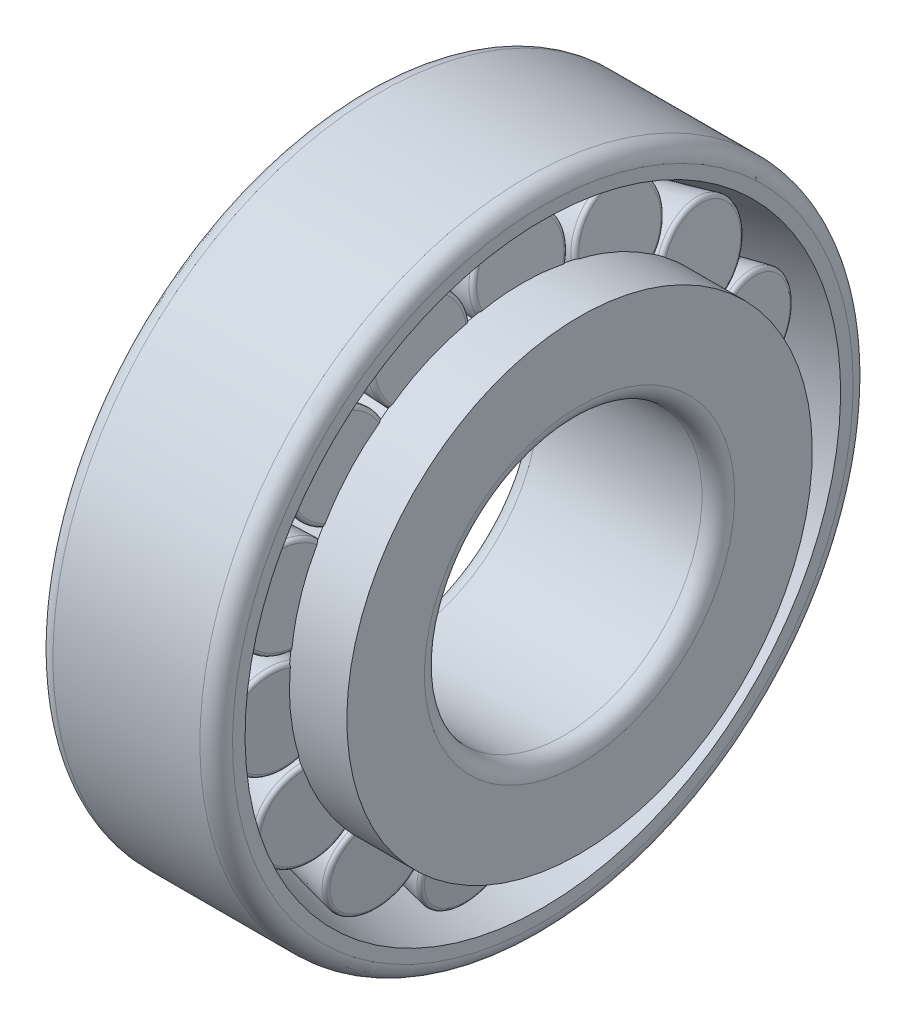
from build123d import *

# Parameters (mm, degrees)
CIRCULAR_PATTERN1_COUNT = 15


with BuildPart() as part:
    # Sketch1 → Revolve1 (revolve)
    with BuildSketch(Plane.XY, mode=Mode.PRIVATE) as revolve1_sk:
        with BuildLine():
            Line((-2.972383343, 11.740897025), (-3.181939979, 13.240897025))
            Line((-3.181939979, 13.240897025), (-4.25, 13.240897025))
            Line((-4.25, 13.240897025), (-4.25, 9.5))
            ThreePointArc((-4.25, 9.5), (-3.957106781, 8.792893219), (-3.25, 8.5))
            Line((-3.25, 8.5), (6.75, 8.5))
            ThreePointArc((6.75, 8.5), (7.457106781, 8.792893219), (7.75, 9.5))
            Line((7.75, 9.5), (7.75, 14.25))
            Line((7.75, 14.25), (4.203318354, 14.25))
            Line((4.203318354, 14.25), (4.5, 12.126361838))
            Line((4.5, 12.126361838), (-2.972383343, 11.740897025))
        make_face()
    revolve(revolve1_sk.sketch.rotate(Axis((7.75, 0, 0), (1, 0, 0)), 180), axis=Axis((7.75, 0, 0), (1, 0, 0)))

    # Sketch2 → Revolve2 (revolve)
    with BuildSketch(Plane.XY, mode=Mode.PRIVATE) as revolve2_sk:
        with BuildLine():
            Line((-3.29974931, 13.939622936), (4.122020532, 14.976477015))
            Line((4.122020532, 14.976477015), (4.488098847, 12.356099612))
            ThreePointArc((4.488098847, 12.356099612), (4.437664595, 12.17783312), (4.272159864, 12.094582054))
            Line((4.272159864, 12.094582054), (-2.779178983, 11.730836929))
            ThreePointArc((-2.779178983, 11.730836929), (-2.937471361, 11.783177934), (-3.018815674, 11.928708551))
            Line((-3.018815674, 11.928708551), (-3.29974931, 13.939622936))
        make_face()
    revolve2 = revolve(revolve2_sk.sketch.rotate(Axis((-3.29974931, 13.939622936, 0), (0.9903818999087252, 0.13836073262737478, 0)), 6.09027715), axis=Axis((-3.29974931, 13.939622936, 0), (0.9903818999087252, 0.13836073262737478, 0)))

    # Sketch3 → Revolve3 (revolve)
    with BuildSketch(Plane.XY, mode=Mode.PRIVATE) as revolve3_sk:
        with BuildLine():
            Line((-5.5, 15.704), (5.5, 18.234047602))
            Line((5.5, 18.234047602), (5.5, 19))
            ThreePointArc((5.5, 19), (5.207106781, 19.707106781), (4.5, 20))
            Line((4.5, 20), (-4.5, 20))
            ThreePointArc((-4.5, 20), (-5.207106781, 19.707106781), (-5.5, 19))
            Line((-5.5, 19), (-5.5, 15.704))
        make_face()
    revolve(revolve3_sk.sketch.rotate(Axis((7.75, 0, 0), (1, 0, 0)), 180), axis=Axis((7.75, 0, 0), (1, 0, 0)))

    # Circular-Pattern1: Revolve2 ×15 about axis
    circular_pattern1_axis = Axis((0, 0, 0), (1, 0, 0))
    for i in range(1, CIRCULAR_PATTERN1_COUNT):
        add(revolve2.rotate(circular_pattern1_axis, i * 360 / CIRCULAR_PATTERN1_COUNT))


solid = part.part
